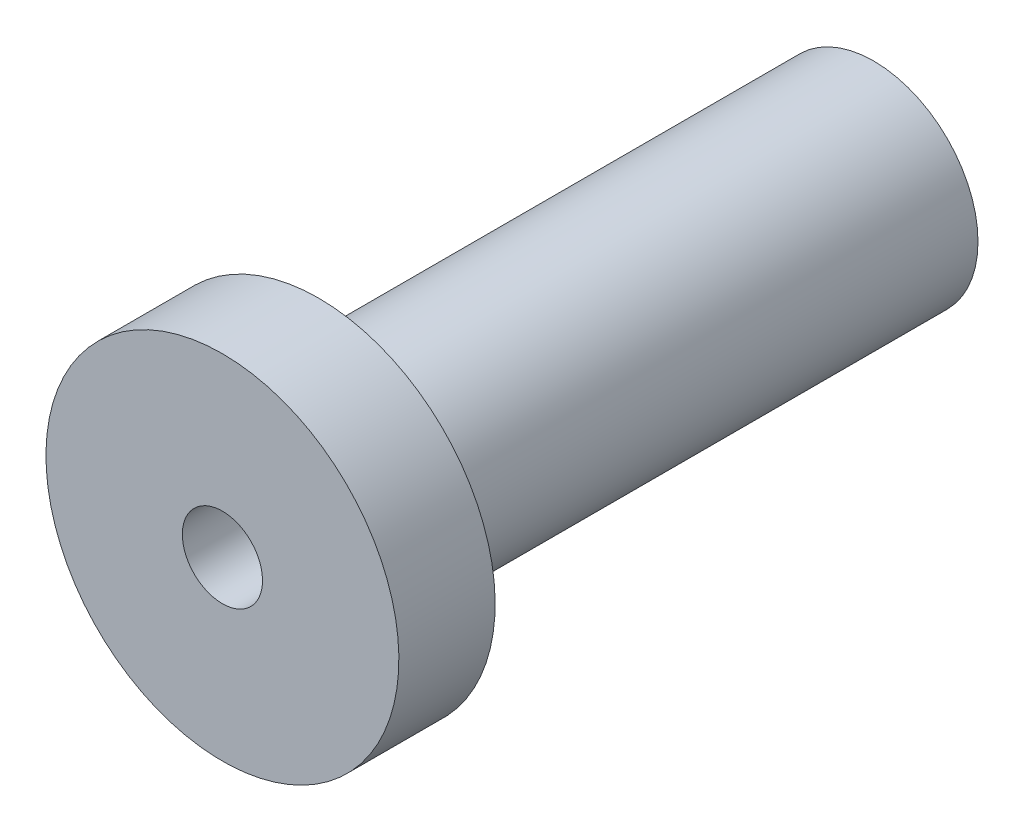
ISO-10303-21;
HEADER;
FILE_DESCRIPTION(('STEP AP214'),'2;1');
FILE_NAME('part.step','',(''),(''),'','','');
FILE_SCHEMA(('AUTOMOTIVE_DESIGN { 1 0 10303 214 1 1 1 1 }'));
ENDSEC;
DATA;
#1=APPLICATION_CONTEXT('core data for automotive mechanical design processes');
#2=APPLICATION_PROTOCOL_DEFINITION('international standard','automotive_design',2000,#1);
#3=PRODUCT_CONTEXT('',#1,'mechanical');
#4=PRODUCT('Part','Part','',(#3));
#5=PRODUCT_RELATED_PRODUCT_CATEGORY('part','',(#4));
#6=PRODUCT_DEFINITION_FORMATION('','',#4);
#7=PRODUCT_DEFINITION_CONTEXT('part definition',#1,'design');
#8=PRODUCT_DEFINITION('design','',#6,#7);
#9=PRODUCT_DEFINITION_SHAPE('','',#8);
#10=(LENGTH_UNIT() NAMED_UNIT(*) SI_UNIT(.MILLI.,.METRE.));
#11=(NAMED_UNIT(*) PLANE_ANGLE_UNIT() SI_UNIT($,.RADIAN.));
#12=(NAMED_UNIT(*) SI_UNIT($,.STERADIAN.) SOLID_ANGLE_UNIT());
#13=UNCERTAINTY_MEASURE_WITH_UNIT(LENGTH_MEASURE(1.E-05),#10,'distance_accuracy_value','');
#14=(GEOMETRIC_REPRESENTATION_CONTEXT(3) GLOBAL_UNCERTAINTY_ASSIGNED_CONTEXT((#13)) GLOBAL_UNIT_ASSIGNED_CONTEXT((#10,
#11,#12)) REPRESENTATION_CONTEXT('',''));
#15=CARTESIAN_POINT('',(0.,0.,0.));
#16=DIRECTION('',(0.,0.,1.));
#17=DIRECTION('',(1.,0.,0.));
#18=AXIS2_PLACEMENT_3D('',#15,#16,#17);
#19=CARTESIAN_POINT('',(0.,0.,-34.6));
#20=DIRECTION('',(0.,0.,-1.));
#21=DIRECTION('',(0.,1.,0.));
#22=AXIS2_PLACEMENT_3D('',#19,#20,#21);
#23=PLANE('',#22);
#24=CARTESIAN_POINT('',(0.,0.,-34.6));
#25=DIRECTION('',(0.,0.,-1.));
#26=DIRECTION('',(0.,1.,0.));
#27=AXIS2_PLACEMENT_3D('',#24,#25,#26);
#28=CIRCLE('',#27,6.5);
#29=CARTESIAN_POINT('',(0.,6.5,-34.6));
#30=VERTEX_POINT('',#29);
#31=EDGE_CURVE('E8',#30,#30,#28,.T.);
#32=ORIENTED_EDGE('',*,*,#31,.T.);
#33=EDGE_LOOP('',(#32));
#34=FACE_BOUND('',#33,.T.);
#35=ADVANCED_FACE('F12',(#34),#23,.T.);
#36=CARTESIAN_POINT('',(0.,0.,-44.6));
#37=DIRECTION('',(0.,0.,-1.));
#38=DIRECTION('',(0.,1.,0.));
#39=AXIS2_PLACEMENT_3D('',#36,#37,#38);
#40=CYLINDRICAL_SURFACE('',#39,6.5);
#41=CARTESIAN_POINT('',(0.,0.,0.));
#42=DIRECTION('',(0.,0.,-1.));
#43=DIRECTION('',(0.,1.,0.));
#44=AXIS2_PLACEMENT_3D('',#41,#42,#43);
#45=CIRCLE('',#44,6.5);
#46=CARTESIAN_POINT('',(0.,6.5,0.));
#47=VERTEX_POINT('',#46);
#48=EDGE_CURVE('E18',#47,#47,#45,.T.);
#49=ORIENTED_EDGE('',*,*,#48,.T.);
#50=EDGE_LOOP('',(#49));
#51=FACE_BOUND('',#50,.T.);
#52=ORIENTED_EDGE('',*,*,#31,.F.);
#53=EDGE_LOOP('',(#52));
#54=FACE_BOUND('',#53,.T.);
#55=ADVANCED_FACE('F61',(#51,#54),#40,.T.);
#56=CARTESIAN_POINT('',(6.5,0.,0.));
#57=DIRECTION('',(0.,0.,-1.));
#58=DIRECTION('',(0.,1.,0.));
#59=AXIS2_PLACEMENT_3D('',#56,#57,#58);
#60=PLANE('',#59);
#61=CARTESIAN_POINT('',(0.,0.,0.));
#62=DIRECTION('',(0.,0.,-1.));
#63=DIRECTION('',(0.,1.,0.));
#64=AXIS2_PLACEMENT_3D('',#61,#62,#63);
#65=CIRCLE('',#64,11.);
#66=CARTESIAN_POINT('',(0.,11.,0.));
#67=VERTEX_POINT('',#66);
#68=EDGE_CURVE('E22',#67,#67,#65,.T.);
#69=ORIENTED_EDGE('',*,*,#68,.T.);
#70=EDGE_LOOP('',(#69));
#71=FACE_BOUND('',#70,.T.);
#72=ORIENTED_EDGE('',*,*,#48,.F.);
#73=EDGE_LOOP('',(#72));
#74=FACE_BOUND('',#73,.T.);
#75=ADVANCED_FACE('F55',(#71,#74),#60,.T.);
#76=CARTESIAN_POINT('',(0.,0.,-44.6));
#77=DIRECTION('',(0.,0.,-1.));
#78=DIRECTION('',(0.,1.,0.));
#79=AXIS2_PLACEMENT_3D('',#76,#77,#78);
#80=CYLINDRICAL_SURFACE('',#79,11.);
#81=CARTESIAN_POINT('',(0.,0.,6.));
#82=DIRECTION('',(0.,0.,-1.));
#83=DIRECTION('',(0.,1.,0.));
#84=AXIS2_PLACEMENT_3D('',#81,#82,#83);
#85=CIRCLE('',#84,11.);
#86=CARTESIAN_POINT('',(0.,11.,6.));
#87=VERTEX_POINT('',#86);
#88=EDGE_CURVE('E26',#87,#87,#85,.T.);
#89=ORIENTED_EDGE('',*,*,#88,.T.);
#90=EDGE_LOOP('',(#89));
#91=FACE_BOUND('',#90,.T.);
#92=ORIENTED_EDGE('',*,*,#68,.F.);
#93=EDGE_LOOP('',(#92));
#94=FACE_BOUND('',#93,.T.);
#95=ADVANCED_FACE('F49',(#91,#94),#80,.T.);
#96=CARTESIAN_POINT('',(11.,0.,6.));
#97=DIRECTION('',(0.,0.,1.));
#98=DIRECTION('',(0.,-1.,0.));
#99=AXIS2_PLACEMENT_3D('',#96,#97,#98);
#100=PLANE('',#99);
#101=CARTESIAN_POINT('',(0.,0.,6.));
#102=DIRECTION('',(0.,0.,1.));
#103=DIRECTION('',(0.,-1.,0.));
#104=AXIS2_PLACEMENT_3D('',#101,#102,#103);
#105=CIRCLE('',#104,2.5);
#106=CARTESIAN_POINT('',(0.,-2.5,6.));
#107=VERTEX_POINT('',#106);
#108=EDGE_CURVE('E32',#107,#107,#105,.T.);
#109=ORIENTED_EDGE('',*,*,#108,.F.);
#110=EDGE_LOOP('',(#109));
#111=FACE_BOUND('',#110,.T.);
#112=ORIENTED_EDGE('',*,*,#88,.F.);
#113=EDGE_LOOP('',(#112));
#114=FACE_BOUND('',#113,.T.);
#115=ADVANCED_FACE('F43',(#111,#114),#100,.T.);
#116=CARTESIAN_POINT('',(0.,0.,-24.5));
#117=DIRECTION('',(0.,0.,1.));
#118=DIRECTION('',(0.,-1.,0.));
#119=AXIS2_PLACEMENT_3D('',#116,#117,#118);
#120=CYLINDRICAL_SURFACE('',#119,2.5);
#121=CARTESIAN_POINT('',(0.,0.,-24.5));
#122=DIRECTION('',(0.,0.,1.));
#123=DIRECTION('',(0.,-1.,0.));
#124=AXIS2_PLACEMENT_3D('',#121,#122,#123);
#125=CIRCLE('',#124,2.5);
#126=CARTESIAN_POINT('',(0.,-2.5,-24.5));
#127=VERTEX_POINT('',#126);
#128=EDGE_CURVE('E31',#127,#127,#125,.T.);
#129=ORIENTED_EDGE('',*,*,#128,.F.);
#130=EDGE_LOOP('',(#129));
#131=FACE_BOUND('',#130,.T.);
#132=ORIENTED_EDGE('',*,*,#108,.T.);
#133=EDGE_LOOP('',(#132));
#134=FACE_BOUND('',#133,.T.);
#135=ADVANCED_FACE('F40',(#131,#134),#120,.F.);
#136=CARTESIAN_POINT('',(0.,0.,-24.5));
#137=DIRECTION('',(0.,0.,1.));
#138=DIRECTION('',(0.,-1.,0.));
#139=AXIS2_PLACEMENT_3D('',#136,#137,#138);
#140=PLANE('',#139);
#141=ORIENTED_EDGE('',*,*,#128,.T.);
#142=EDGE_LOOP('',(#141));
#143=FACE_BOUND('',#142,.T.);
#144=ADVANCED_FACE('F38',(#143),#140,.T.);
#145=CLOSED_SHELL('',(#35,#55,#75,#95,#115,#135,#144));
#146=MANIFOLD_SOLID_BREP('B1',#145);
#147=ADVANCED_BREP_SHAPE_REPRESENTATION('',(#18,#146),#14);
#148=SHAPE_DEFINITION_REPRESENTATION(#9,#147);
ENDSEC;
END-ISO-10303-21;
